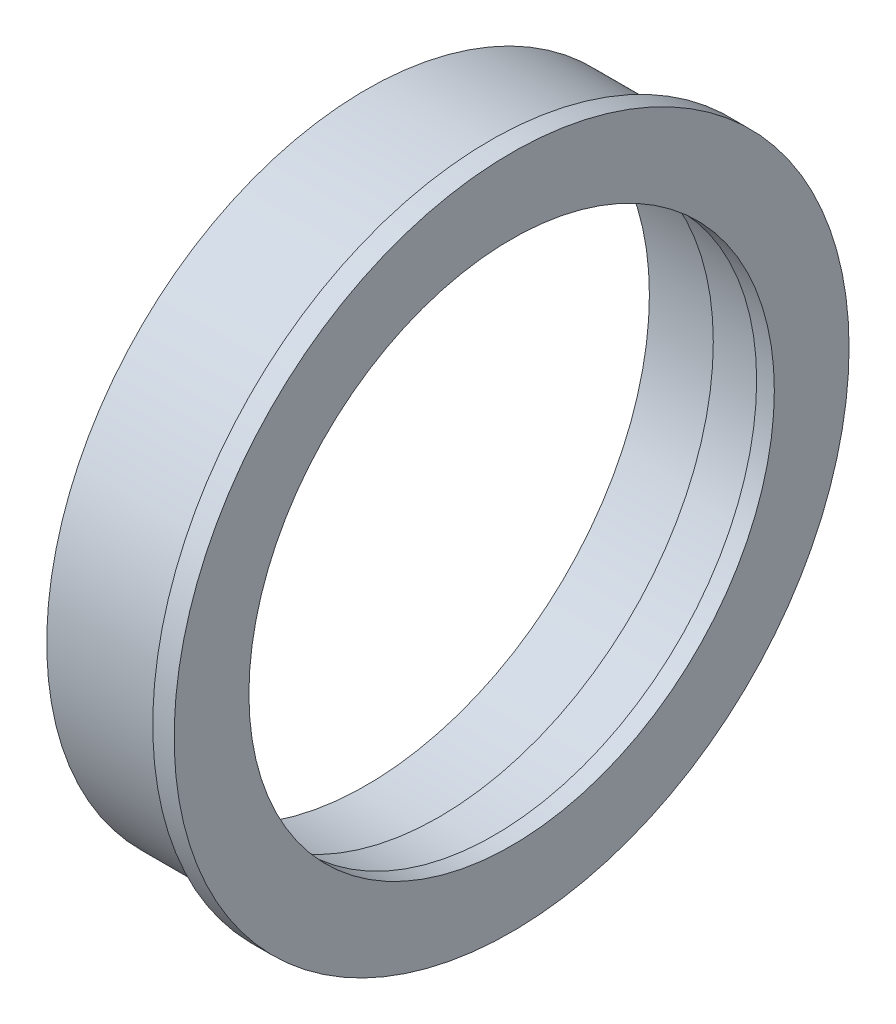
from build123d import *


with BuildPart() as part:
    # Sketch1 → Revolve1 (revolve)
    with BuildSketch(Plane.XY, mode=Mode.PRIVATE) as revolve1_sk:
        Polygon((0.043921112, 31.85), (-6.333940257, 31.85), (-6.333940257, 32.887298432), (-14.791860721, 32.887298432), (-14.791860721, 37.090748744), (-0.388834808, 37.090748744), (-0.388834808, 39.183869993), (2.097265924, 39.183869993), (2.097265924, 30.506201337), (0.043921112, 30.506201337), align=None)
    revolve(revolve1_sk.sketch.rotate(Axis((4.254332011, 0, 0), (-1, 0, 0)), 90), axis=Axis((4.254332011, 0, 0), (-1, 0, 0)))


solid = part.part
